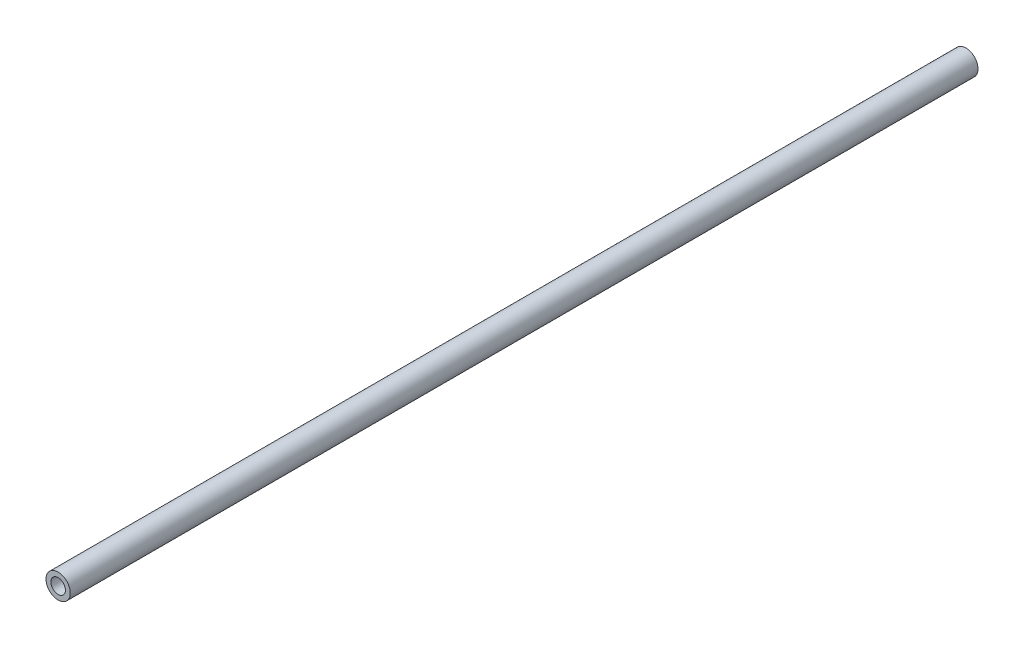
ISO-10303-21;
HEADER;
FILE_DESCRIPTION(('STEP AP214'),'2;1');
FILE_NAME('part.step','',(''),(''),'','','');
FILE_SCHEMA(('AUTOMOTIVE_DESIGN { 1 0 10303 214 1 1 1 1 }'));
ENDSEC;
DATA;
#1=APPLICATION_CONTEXT('core data for automotive mechanical design processes');
#2=APPLICATION_PROTOCOL_DEFINITION('international standard','automotive_design',2000,#1);
#3=PRODUCT_CONTEXT('',#1,'mechanical');
#4=PRODUCT('Part','Part','',(#3));
#5=PRODUCT_RELATED_PRODUCT_CATEGORY('part','',(#4));
#6=PRODUCT_DEFINITION_FORMATION('','',#4);
#7=PRODUCT_DEFINITION_CONTEXT('part definition',#1,'design');
#8=PRODUCT_DEFINITION('design','',#6,#7);
#9=PRODUCT_DEFINITION_SHAPE('','',#8);
#10=(LENGTH_UNIT() NAMED_UNIT(*) SI_UNIT(.MILLI.,.METRE.));
#11=(NAMED_UNIT(*) PLANE_ANGLE_UNIT() SI_UNIT($,.RADIAN.));
#12=(NAMED_UNIT(*) SI_UNIT($,.STERADIAN.) SOLID_ANGLE_UNIT());
#13=UNCERTAINTY_MEASURE_WITH_UNIT(LENGTH_MEASURE(1.E-05),#10,'distance_accuracy_value','');
#14=(GEOMETRIC_REPRESENTATION_CONTEXT(3) GLOBAL_UNCERTAINTY_ASSIGNED_CONTEXT((#13)) GLOBAL_UNIT_ASSIGNED_CONTEXT((#10,
#11,#12)) REPRESENTATION_CONTEXT('',''));
#15=CARTESIAN_POINT('',(0.,0.,0.));
#16=DIRECTION('',(0.,0.,1.));
#17=DIRECTION('',(1.,0.,0.));
#18=AXIS2_PLACEMENT_3D('',#15,#16,#17);
#19=CARTESIAN_POINT('',(0.,0.,474.98));
#20=DIRECTION('',(0.,0.,1.));
#21=DIRECTION('',(1.,0.,0.));
#22=AXIS2_PLACEMENT_3D('',#19,#20,#21);
#23=PLANE('',#22);
#24=CARTESIAN_POINT('',(0.,0.,474.98));
#25=DIRECTION('',(0.,0.,1.));
#26=DIRECTION('',(1.,0.,0.));
#27=AXIS2_PLACEMENT_3D('',#24,#25,#26);
#28=CIRCLE('',#27,6.35);
#29=CARTESIAN_POINT('',(-6.35,0.,474.98));
#30=VERTEX_POINT('',#29);
#31=EDGE_CURVE('E10',#30,#30,#28,.T.);
#32=ORIENTED_EDGE('',*,*,#31,.T.);
#33=EDGE_LOOP('',(#32));
#34=FACE_BOUND('',#33,.T.);
#35=CARTESIAN_POINT('',(0.,0.,474.98));
#36=DIRECTION('',(0.,0.,1.));
#37=DIRECTION('',(1.,0.,0.));
#38=AXIS2_PLACEMENT_3D('',#35,#36,#37);
#39=CIRCLE('',#38,3.81);
#40=CARTESIAN_POINT('',(-3.81,0.,474.98));
#41=VERTEX_POINT('',#40);
#42=EDGE_CURVE('E41',#41,#41,#39,.T.);
#43=ORIENTED_EDGE('',*,*,#42,.F.);
#44=EDGE_LOOP('',(#43));
#45=FACE_BOUND('',#44,.T.);
#46=ADVANCED_FACE('F30',(#34,#45),#23,.T.);
#47=CARTESIAN_POINT('',(0.,0.,0.));
#48=DIRECTION('',(0.,0.,1.));
#49=DIRECTION('',(1.,0.,0.));
#50=AXIS2_PLACEMENT_3D('',#47,#48,#49);
#51=PLANE('',#50);
#52=CARTESIAN_POINT('',(0.,0.,0.));
#53=DIRECTION('',(0.,0.,1.));
#54=DIRECTION('',(1.,0.,0.));
#55=AXIS2_PLACEMENT_3D('',#52,#53,#54);
#56=CIRCLE('',#55,6.35);
#57=CARTESIAN_POINT('',(-6.35,0.,0.));
#58=VERTEX_POINT('',#57);
#59=EDGE_CURVE('E37',#58,#58,#56,.T.);
#60=ORIENTED_EDGE('',*,*,#59,.F.);
#61=EDGE_LOOP('',(#60));
#62=FACE_BOUND('',#61,.T.);
#63=CARTESIAN_POINT('',(0.,0.,0.));
#64=DIRECTION('',(0.,0.,1.));
#65=DIRECTION('',(1.,0.,0.));
#66=AXIS2_PLACEMENT_3D('',#63,#64,#65);
#67=CIRCLE('',#66,3.81);
#68=CARTESIAN_POINT('',(-3.81,0.,0.));
#69=VERTEX_POINT('',#68);
#70=EDGE_CURVE('E45',#69,#69,#67,.T.);
#71=ORIENTED_EDGE('',*,*,#70,.T.);
#72=EDGE_LOOP('',(#71));
#73=FACE_BOUND('',#72,.T.);
#74=ADVANCED_FACE('F51',(#62,#73),#51,.F.);
#75=CARTESIAN_POINT('',(0.,0.,474.98));
#76=DIRECTION('',(0.,0.,-1.));
#77=DIRECTION('',(-1.,0.,0.));
#78=AXIS2_PLACEMENT_3D('',#75,#76,#77);
#79=CYLINDRICAL_SURFACE('',#78,6.35);
#80=CARTESIAN_POINT('',(-6.35,0.,474.98));
#81=CARTESIAN_POINT('',(-6.35,0.,470.032291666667));
#82=CARTESIAN_POINT('',(-6.35,0.,465.084583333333));
#83=CARTESIAN_POINT('',(-6.35,0.,455.189166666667));
#84=CARTESIAN_POINT('',(-6.35,0.,450.241458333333));
#85=CARTESIAN_POINT('',(-6.35,0.,440.346041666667));
#86=CARTESIAN_POINT('',(-6.35,0.,435.398333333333));
#87=CARTESIAN_POINT('',(-6.35,0.,425.502916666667));
#88=CARTESIAN_POINT('',(-6.35,0.,420.555208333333));
#89=CARTESIAN_POINT('',(-6.35,0.,410.659791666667));
#90=CARTESIAN_POINT('',(-6.35,0.,405.712083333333));
#91=CARTESIAN_POINT('',(-6.35,0.,395.816666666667));
#92=CARTESIAN_POINT('',(-6.35,0.,390.868958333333));
#93=CARTESIAN_POINT('',(-6.35,0.,380.973541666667));
#94=CARTESIAN_POINT('',(-6.35,0.,376.025833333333));
#95=CARTESIAN_POINT('',(-6.35,0.,366.130416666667));
#96=CARTESIAN_POINT('',(-6.35,0.,361.182708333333));
#97=CARTESIAN_POINT('',(-6.35,0.,351.287291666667));
#98=CARTESIAN_POINT('',(-6.35,0.,346.339583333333));
#99=CARTESIAN_POINT('',(-6.35,0.,336.444166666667));
#100=CARTESIAN_POINT('',(-6.35,0.,331.496458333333));
#101=CARTESIAN_POINT('',(-6.35,0.,321.601041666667));
#102=CARTESIAN_POINT('',(-6.35,0.,316.653333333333));
#103=CARTESIAN_POINT('',(-6.35,0.,306.757916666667));
#104=CARTESIAN_POINT('',(-6.35,0.,301.810208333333));
#105=CARTESIAN_POINT('',(-6.35,0.,291.914791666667));
#106=CARTESIAN_POINT('',(-6.35,0.,286.967083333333));
#107=CARTESIAN_POINT('',(-6.35,0.,277.071666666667));
#108=CARTESIAN_POINT('',(-6.35,0.,272.123958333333));
#109=CARTESIAN_POINT('',(-6.35,0.,262.228541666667));
#110=CARTESIAN_POINT('',(-6.35,0.,257.280833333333));
#111=CARTESIAN_POINT('',(-6.35,0.,247.385416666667));
#112=CARTESIAN_POINT('',(-6.35,0.,242.437708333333));
#113=CARTESIAN_POINT('',(-6.35,0.,232.542291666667));
#114=CARTESIAN_POINT('',(-6.35,0.,227.594583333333));
#115=CARTESIAN_POINT('',(-6.35,0.,217.699166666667));
#116=CARTESIAN_POINT('',(-6.35,0.,212.751458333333));
#117=CARTESIAN_POINT('',(-6.35,0.,202.856041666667));
#118=CARTESIAN_POINT('',(-6.35,0.,197.908333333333));
#119=CARTESIAN_POINT('',(-6.35,0.,188.012916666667));
#120=CARTESIAN_POINT('',(-6.35,0.,183.065208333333));
#121=CARTESIAN_POINT('',(-6.35,0.,173.169791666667));
#122=CARTESIAN_POINT('',(-6.35,0.,168.222083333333));
#123=CARTESIAN_POINT('',(-6.35,0.,158.326666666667));
#124=CARTESIAN_POINT('',(-6.35,0.,153.378958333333));
#125=CARTESIAN_POINT('',(-6.35,0.,143.483541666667));
#126=CARTESIAN_POINT('',(-6.35,0.,138.535833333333));
#127=CARTESIAN_POINT('',(-6.35,0.,128.640416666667));
#128=CARTESIAN_POINT('',(-6.35,0.,123.692708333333));
#129=CARTESIAN_POINT('',(-6.35,0.,113.797291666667));
#130=CARTESIAN_POINT('',(-6.35,0.,108.849583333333));
#131=CARTESIAN_POINT('',(-6.35,0.,98.9541666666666));
#132=CARTESIAN_POINT('',(-6.35,0.,94.0064583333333));
#133=CARTESIAN_POINT('',(-6.35,0.,84.1110416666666));
#134=CARTESIAN_POINT('',(-6.35,0.,79.1633333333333));
#135=CARTESIAN_POINT('',(-6.35,0.,69.2679166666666));
#136=CARTESIAN_POINT('',(-6.35,0.,64.3202083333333));
#137=CARTESIAN_POINT('',(-6.35,0.,54.4247916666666));
#138=CARTESIAN_POINT('',(-6.35,0.,49.4770833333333));
#139=CARTESIAN_POINT('',(-6.35,0.,39.5816666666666));
#140=CARTESIAN_POINT('',(-6.35,0.,34.6339583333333));
#141=CARTESIAN_POINT('',(-6.35,0.,24.7385416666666));
#142=CARTESIAN_POINT('',(-6.35,0.,19.7908333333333));
#143=CARTESIAN_POINT('',(-6.35,0.,9.89541666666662));
#144=CARTESIAN_POINT('',(-6.35,0.,4.94770833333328));
#145=CARTESIAN_POINT('',(-6.35,0.,0.));
#146=B_SPLINE_CURVE_WITH_KNOTS('',3,(#80,#81,#82,#83,#84,#85,#86,#87,#88,#89,#90,#91,#92,#93,
#94,#95,#96,#97,#98,#99,#100,#101,#102,#103,#104,#105,#106,#107,#108,#109,#110,#111,#112,#113,
#114,#115,#116,#117,#118,#119,#120,#121,#122,#123,#124,#125,#126,#127,#128,#129,#130,#131,#132,
#133,#134,#135,#136,#137,#138,#139,#140,#141,#142,#143,#144,#145),.UNSPECIFIED.,.F.,.F.,(4,2,2,
2,2,2,2,2,2,2,2,2,2,2,2,2,2,2,2,2,2,2,2,2,2,2,2,2,2,2,2,2,4),(0.,14.843125,29.68625,44.529375,
59.3725,74.2156249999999,89.05875,103.901875,118.745,133.588125,148.43125,163.274375,178.1175,
192.960625,207.80375,222.646875,237.49,252.333125,267.17625,282.019375,296.8625,311.705625,
326.54875,341.391875,356.235,371.078125,385.92125,400.764375,415.6075,430.450625,445.29375,
460.136875,474.98),.UNSPECIFIED.);
#147=EDGE_CURVE('BSEAM32',#30,#58,#146,.T.);
#148=ORIENTED_EDGE('',*,*,#31,.F.);
#149=ORIENTED_EDGE('',*,*,#59,.T.);
#150=ORIENTED_EDGE('',*,*,#147,.T.);
#151=ORIENTED_EDGE('',*,*,#147,.F.);
#152=EDGE_LOOP('',(#148,#150,#149,#151));
#153=FACE_BOUND('',#152,.T.);
#154=ADVANCED_FACE('F32',(#153),#79,.T.);
#155=CARTESIAN_POINT('',(0.,0.,474.98));
#156=DIRECTION('',(0.,0.,-1.));
#157=DIRECTION('',(-1.,0.,0.));
#158=AXIS2_PLACEMENT_3D('',#155,#156,#157);
#159=CYLINDRICAL_SURFACE('',#158,3.81);
#160=CARTESIAN_POINT('',(-3.81,0.,474.98));
#161=CARTESIAN_POINT('',(-3.81,0.,470.032291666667));
#162=CARTESIAN_POINT('',(-3.81,0.,465.084583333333));
#163=CARTESIAN_POINT('',(-3.81,0.,455.189166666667));
#164=CARTESIAN_POINT('',(-3.81,0.,450.241458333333));
#165=CARTESIAN_POINT('',(-3.81,0.,440.346041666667));
#166=CARTESIAN_POINT('',(-3.81,0.,435.398333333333));
#167=CARTESIAN_POINT('',(-3.81,0.,425.502916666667));
#168=CARTESIAN_POINT('',(-3.81,0.,420.555208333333));
#169=CARTESIAN_POINT('',(-3.81,0.,410.659791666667));
#170=CARTESIAN_POINT('',(-3.81,0.,405.712083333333));
#171=CARTESIAN_POINT('',(-3.81,0.,395.816666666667));
#172=CARTESIAN_POINT('',(-3.81,0.,390.868958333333));
#173=CARTESIAN_POINT('',(-3.81,0.,380.973541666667));
#174=CARTESIAN_POINT('',(-3.81,0.,376.025833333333));
#175=CARTESIAN_POINT('',(-3.81,0.,366.130416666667));
#176=CARTESIAN_POINT('',(-3.81,0.,361.182708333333));
#177=CARTESIAN_POINT('',(-3.81,0.,351.287291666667));
#178=CARTESIAN_POINT('',(-3.81,0.,346.339583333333));
#179=CARTESIAN_POINT('',(-3.81,0.,336.444166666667));
#180=CARTESIAN_POINT('',(-3.81,0.,331.496458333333));
#181=CARTESIAN_POINT('',(-3.81,0.,321.601041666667));
#182=CARTESIAN_POINT('',(-3.81,0.,316.653333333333));
#183=CARTESIAN_POINT('',(-3.81,0.,306.757916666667));
#184=CARTESIAN_POINT('',(-3.81,0.,301.810208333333));
#185=CARTESIAN_POINT('',(-3.81,0.,291.914791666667));
#186=CARTESIAN_POINT('',(-3.81,0.,286.967083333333));
#187=CARTESIAN_POINT('',(-3.81,0.,277.071666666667));
#188=CARTESIAN_POINT('',(-3.81,0.,272.123958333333));
#189=CARTESIAN_POINT('',(-3.81,0.,262.228541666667));
#190=CARTESIAN_POINT('',(-3.81,0.,257.280833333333));
#191=CARTESIAN_POINT('',(-3.81,0.,247.385416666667));
#192=CARTESIAN_POINT('',(-3.81,0.,242.437708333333));
#193=CARTESIAN_POINT('',(-3.81,0.,232.542291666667));
#194=CARTESIAN_POINT('',(-3.81,0.,227.594583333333));
#195=CARTESIAN_POINT('',(-3.81,0.,217.699166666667));
#196=CARTESIAN_POINT('',(-3.81,0.,212.751458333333));
#197=CARTESIAN_POINT('',(-3.81,0.,202.856041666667));
#198=CARTESIAN_POINT('',(-3.81,0.,197.908333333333));
#199=CARTESIAN_POINT('',(-3.81,0.,188.012916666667));
#200=CARTESIAN_POINT('',(-3.81,0.,183.065208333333));
#201=CARTESIAN_POINT('',(-3.81,0.,173.169791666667));
#202=CARTESIAN_POINT('',(-3.81,0.,168.222083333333));
#203=CARTESIAN_POINT('',(-3.81,0.,158.326666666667));
#204=CARTESIAN_POINT('',(-3.81,0.,153.378958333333));
#205=CARTESIAN_POINT('',(-3.81,0.,143.483541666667));
#206=CARTESIAN_POINT('',(-3.81,0.,138.535833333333));
#207=CARTESIAN_POINT('',(-3.81,0.,128.640416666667));
#208=CARTESIAN_POINT('',(-3.81,0.,123.692708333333));
#209=CARTESIAN_POINT('',(-3.81,0.,113.797291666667));
#210=CARTESIAN_POINT('',(-3.81,0.,108.849583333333));
#211=CARTESIAN_POINT('',(-3.81,0.,98.9541666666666));
#212=CARTESIAN_POINT('',(-3.81,0.,94.0064583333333));
#213=CARTESIAN_POINT('',(-3.81,0.,84.1110416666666));
#214=CARTESIAN_POINT('',(-3.81,0.,79.1633333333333));
#215=CARTESIAN_POINT('',(-3.81,0.,69.2679166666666));
#216=CARTESIAN_POINT('',(-3.81,0.,64.3202083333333));
#217=CARTESIAN_POINT('',(-3.81,0.,54.4247916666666));
#218=CARTESIAN_POINT('',(-3.81,0.,49.4770833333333));
#219=CARTESIAN_POINT('',(-3.81,0.,39.5816666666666));
#220=CARTESIAN_POINT('',(-3.81,0.,34.6339583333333));
#221=CARTESIAN_POINT('',(-3.81,0.,24.7385416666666));
#222=CARTESIAN_POINT('',(-3.81,0.,19.7908333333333));
#223=CARTESIAN_POINT('',(-3.81,0.,9.89541666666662));
#224=CARTESIAN_POINT('',(-3.81,0.,4.94770833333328));
#225=CARTESIAN_POINT('',(-3.81,0.,0.));
#226=B_SPLINE_CURVE_WITH_KNOTS('',3,(#160,#161,#162,#163,#164,#165,#166,#167,#168,#169,#170,
#171,#172,#173,#174,#175,#176,#177,#178,#179,#180,#181,#182,#183,#184,#185,#186,#187,#188,#189,
#190,#191,#192,#193,#194,#195,#196,#197,#198,#199,#200,#201,#202,#203,#204,#205,#206,#207,#208,
#209,#210,#211,#212,#213,#214,#215,#216,#217,#218,#219,#220,#221,#222,#223,#224,#225),
.UNSPECIFIED.,.F.,.F.,(4,2,2,2,2,2,2,2,2,2,2,2,2,2,2,2,2,2,2,2,2,2,2,2,2,2,2,2,2,2,2,2,4),(0.,
14.843125,29.68625,44.529375,59.3725000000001,74.215625,89.05875,103.901875,118.745,133.588125,
148.43125,163.274375,178.1175,192.960625,207.80375,222.646875,237.49,252.333125,267.17625,
282.019375,296.8625,311.705625,326.54875,341.391875,356.235,371.078125,385.92125,400.764375,
415.6075,430.450625,445.29375,460.136875,474.98),.UNSPECIFIED.);
#227=EDGE_CURVE('BSEAM53',#41,#69,#226,.T.);
#228=ORIENTED_EDGE('',*,*,#42,.T.);
#229=ORIENTED_EDGE('',*,*,#70,.F.);
#230=ORIENTED_EDGE('',*,*,#227,.T.);
#231=ORIENTED_EDGE('',*,*,#227,.F.);
#232=EDGE_LOOP('',(#228,#230,#229,#231));
#233=FACE_BOUND('',#232,.T.);
#234=ADVANCED_FACE('F53',(#233),#159,.F.);
#235=CLOSED_SHELL('',(#46,#74,#154,#234));
#236=MANIFOLD_SOLID_BREP('B2',#235);
#237=ADVANCED_BREP_SHAPE_REPRESENTATION('',(#18,#236),#14);
#238=SHAPE_DEFINITION_REPRESENTATION(#9,#237);
ENDSEC;
END-ISO-10303-21;
